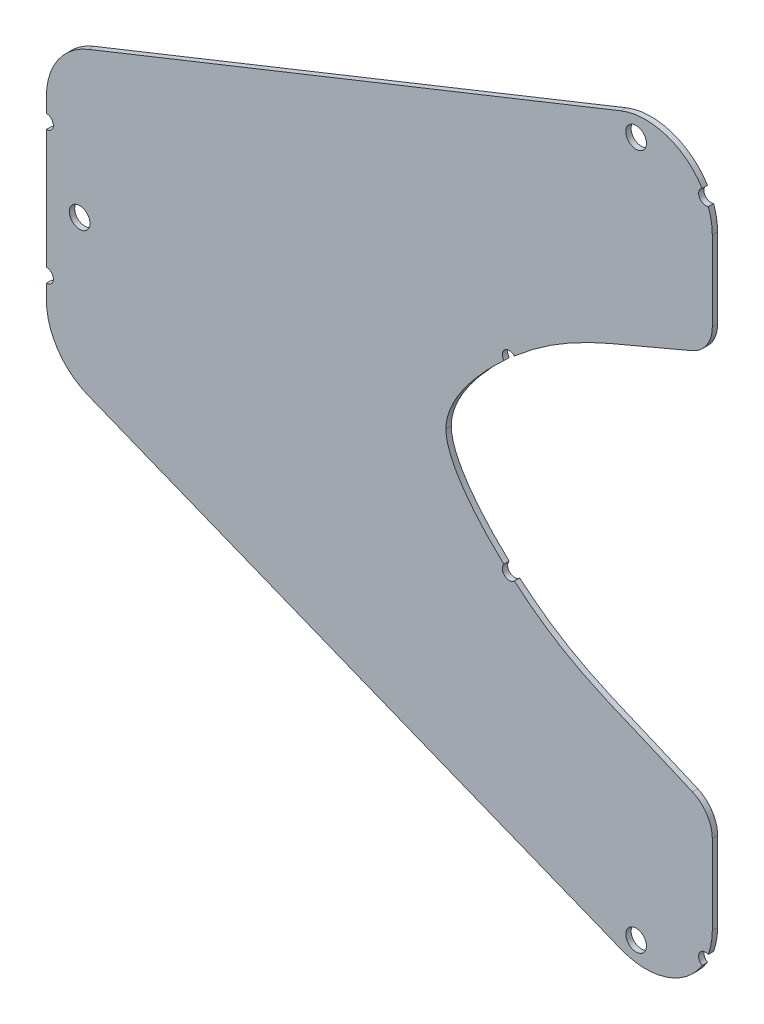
ISO-10303-21;
HEADER;
FILE_DESCRIPTION(('STEP AP214'),'2;1');
FILE_NAME('part.step','',(''),(''),'','','');
FILE_SCHEMA(('AUTOMOTIVE_DESIGN { 1 0 10303 214 1 1 1 1 }'));
ENDSEC;
DATA;
#1=APPLICATION_CONTEXT('core data for automotive mechanical design processes');
#2=APPLICATION_PROTOCOL_DEFINITION('international standard','automotive_design',2000,#1);
#3=PRODUCT_CONTEXT('',#1,'mechanical');
#4=PRODUCT('Part','Part','',(#3));
#5=PRODUCT_RELATED_PRODUCT_CATEGORY('part','',(#4));
#6=PRODUCT_DEFINITION_FORMATION('','',#4);
#7=PRODUCT_DEFINITION_CONTEXT('part definition',#1,'design');
#8=PRODUCT_DEFINITION('design','',#6,#7);
#9=PRODUCT_DEFINITION_SHAPE('','',#8);
#10=(LENGTH_UNIT() NAMED_UNIT(*) SI_UNIT(.MILLI.,.METRE.));
#11=(NAMED_UNIT(*) PLANE_ANGLE_UNIT() SI_UNIT($,.RADIAN.));
#12=(NAMED_UNIT(*) SI_UNIT($,.STERADIAN.) SOLID_ANGLE_UNIT());
#13=UNCERTAINTY_MEASURE_WITH_UNIT(LENGTH_MEASURE(1.E-05),#10,'distance_accuracy_value','');
#14=(GEOMETRIC_REPRESENTATION_CONTEXT(3) GLOBAL_UNCERTAINTY_ASSIGNED_CONTEXT((#13)) GLOBAL_UNIT_ASSIGNED_CONTEXT((#10,
#11,#12)) REPRESENTATION_CONTEXT('',''));
#15=CARTESIAN_POINT('',(0.,0.,0.));
#16=DIRECTION('',(0.,0.,1.));
#17=DIRECTION('',(1.,0.,0.));
#18=AXIS2_PLACEMENT_3D('',#15,#16,#17);
#19=CARTESIAN_POINT('',(62.677439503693,6.54379240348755,0.8));
#20=DIRECTION('',(0.,0.,-1.));
#21=DIRECTION('',(-1.,0.,0.));
#22=AXIS2_PLACEMENT_3D('',#19,#20,#21);
#23=PLANE('',#22);
#24=CARTESIAN_POINT('',(88.5590405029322,52.1925173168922,0.8));
#25=DIRECTION('',(0.,0.,1.));
#26=DIRECTION('',(1.,0.,0.));
#27=AXIS2_PLACEMENT_3D('',#24,#25,#26);
#28=CIRCLE('',#27,1.54999999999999);
#29=CARTESIAN_POINT('',(90.1090405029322,52.1925173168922,0.8));
#30=VERTEX_POINT('',#29);
#31=EDGE_CURVE('E691',#30,#30,#28,.T.);
#32=ORIENTED_EDGE('',*,*,#31,.F.);
#33=EDGE_LOOP('',(#32));
#34=FACE_BOUND('',#33,.T.);
#35=CARTESIAN_POINT('',(60.,0.,0.8));
#36=CARTESIAN_POINT('',(60.0183699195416,3.92846695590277,0.8));
#37=CARTESIAN_POINT('',(64.2193284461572,9.10855984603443,0.8));
#38=CARTESIAN_POINT('',(68.7064209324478,13.2392588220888,0.8));
#39=B_SPLINE_CURVE_WITH_KNOTS('',3,(#35,#36,#37,#38),.UNSPECIFIED.,.F.,.F.,(4,4),
(0.682096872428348,1.),.UNSPECIFIED.);
#40=CARTESIAN_POINT('',(60.,0.,0.8));
#41=VERTEX_POINT('',#40);
#42=CARTESIAN_POINT('',(68.7064209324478,13.2392588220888,0.8));
#43=VERTEX_POINT('',#42);
#44=EDGE_CURVE('E283',#41,#43,#39,.T.);
#45=ORIENTED_EDGE('',*,*,#44,.T.);
#46=CARTESIAN_POINT('',(69.5193173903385,13.9038634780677,0.8));
#47=DIRECTION('',(0.,0.,-1.));
#48=DIRECTION('',(1.,0.,0.));
#49=AXIS2_PLACEMENT_3D('',#46,#47,#48);
#50=CIRCLE('',#49,1.05000000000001);
#51=CARTESIAN_POINT('',(70.2753718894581,14.6324796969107,0.8));
#52=VERTEX_POINT('',#51);
#53=EDGE_CURVE('E210',#43,#52,#50,.T.);
#54=ORIENTED_EDGE('',*,*,#53,.T.);
#55=CARTESIAN_POINT('',(70.2753718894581,14.6324796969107,0.8));
#56=CARTESIAN_POINT('',(70.6636592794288,14.9651158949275,0.8));
#57=CARTESIAN_POINT('',(79.0680221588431,21.9752004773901,0.8));
#58=CARTESIAN_POINT('',(85.7089680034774,23.6688184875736,0.8));
#59=CARTESIAN_POINT('',(97.0260552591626,28.684890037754,0.8));
#60=B_SPLINE_CURVE_WITH_KNOTS('',3,(#55,#56,#57,#58,#59),.UNSPECIFIED.,.F.,.F.,(4,1,4),
(0.0496782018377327,0.0771027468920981,0.64517363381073),.UNSPECIFIED.);
#61=CARTESIAN_POINT('',(97.0260552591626,28.684890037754,0.8));
#62=VERTEX_POINT('',#61);
#63=EDGE_CURVE('E295',#52,#62,#60,.T.);
#64=ORIENTED_EDGE('',*,*,#63,.T.);
#65=CARTESIAN_POINT('',(95.,33.2560058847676,0.8));
#66=DIRECTION('',(0.,0.,1.));
#67=DIRECTION('',(-1.,0.,0.));
#68=AXIS2_PLACEMENT_3D('',#65,#66,#67);
#69=CIRCLE('',#68,5.);
#70=CARTESIAN_POINT('',(100.,33.2560058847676,0.8));
#71=VERTEX_POINT('',#70);
#72=EDGE_CURVE('E300',#62,#71,#69,.T.);
#73=ORIENTED_EDGE('',*,*,#72,.T.);
#74=DIRECTION('',(0.,1.,0.));
#75=VECTOR('',#74,1.);
#76=CARTESIAN_POINT('',(100.,45.2296703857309,0.8));
#77=LINE('',#76,#75);
#78=CARTESIAN_POINT('',(100.,45.2296703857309,0.8));
#79=VERTEX_POINT('',#78);
#80=EDGE_CURVE('E416',#71,#79,#77,.T.);
#81=ORIENTED_EDGE('',*,*,#80,.T.);
#82=CARTESIAN_POINT('',(90.,45.229670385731,0.8));
#83=DIRECTION('',(0.,0.,1.));
#84=DIRECTION('',(-1.,0.,0.));
#85=AXIS2_PLACEMENT_3D('',#82,#83,#84);
#86=CIRCLE('',#85,10.);
#87=CARTESIAN_POINT('',(99.4038271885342,48.6308516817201,0.8));
#88=VERTEX_POINT('',#87);
#89=EDGE_CURVE('E423',#79,#88,#86,.T.);
#90=ORIENTED_EDGE('',*,*,#89,.T.);
#91=CARTESIAN_POINT('',(98.995357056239,49.5981428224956,0.8));
#92=DIRECTION('',(0.,0.,-1.));
#93=DIRECTION('',(1.,0.,0.));
#94=AXIS2_PLACEMENT_3D('',#91,#92,#93);
#95=CIRCLE('',#94,1.05);
#96=CARTESIAN_POINT('',(98.4877131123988,50.5172715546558,0.8));
#97=VERTEX_POINT('',#96);
#98=EDGE_CURVE('E424',#88,#97,#95,.T.);
#99=ORIENTED_EDGE('',*,*,#98,.T.);
#100=CARTESIAN_POINT('',(90.,45.229670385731,0.8));
#101=DIRECTION('',(0.,0.,1.));
#102=DIRECTION('',(-1.,0.,0.));
#103=AXIS2_PLACEMENT_3D('',#100,#101,#102);
#104=CIRCLE('',#103,10.);
#105=CARTESIAN_POINT('',(86.2860932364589,54.5144372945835,0.8));
#106=VERTEX_POINT('',#105);
#107=EDGE_CURVE('E428',#97,#106,#104,.T.);
#108=ORIENTED_EDGE('',*,*,#107,.T.);
#109=DIRECTION('',(-0.928476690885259,-0.371390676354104,0.));
#110=VECTOR('',#109,1.);
#111=CARTESIAN_POINT('',(86.2860932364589,54.5144372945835,0.8));
#112=LINE('',#111,#110);
#113=CARTESIAN_POINT('',(6.28609323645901,22.5144372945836,0.8));
#114=VERTEX_POINT('',#113);
#115=EDGE_CURVE('E430',#106,#114,#112,.T.);
#116=ORIENTED_EDGE('',*,*,#115,.T.);
#117=CARTESIAN_POINT('',(10.,13.229670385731,0.8));
#118=DIRECTION('',(0.,0.,1.));
#119=DIRECTION('',(1.,0.,0.));
#120=AXIS2_PLACEMENT_3D('',#117,#118,#119);
#121=CIRCLE('',#120,10.);
#122=CARTESIAN_POINT('',(0.,13.2296703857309,0.8));
#123=VERTEX_POINT('',#122);
#124=EDGE_CURVE('E432',#114,#123,#121,.T.);
#125=ORIENTED_EDGE('',*,*,#124,.T.);
#126=DIRECTION('',(0.,-1.,0.));
#127=VECTOR('',#126,1.);
#128=CARTESIAN_POINT('',(0.,13.2296703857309,0.8));
#129=LINE('',#128,#127);
#130=CARTESIAN_POINT('',(0.,11.05,0.8));
#131=VERTEX_POINT('',#130);
#132=EDGE_CURVE('E434',#123,#131,#129,.T.);
#133=ORIENTED_EDGE('',*,*,#132,.T.);
#134=CARTESIAN_POINT('',(0.,10.,0.8));
#135=DIRECTION('',(0.,0.,-1.));
#136=DIRECTION('',(1.,0.,0.));
#137=AXIS2_PLACEMENT_3D('',#134,#135,#136);
#138=CIRCLE('',#137,1.05);
#139=CARTESIAN_POINT('',(0.,8.95,0.8));
#140=VERTEX_POINT('',#139);
#141=EDGE_CURVE('E436',#131,#140,#138,.T.);
#142=ORIENTED_EDGE('',*,*,#141,.T.);
#143=DIRECTION('',(0.,-1.,0.));
#144=VECTOR('',#143,1.);
#145=CARTESIAN_POINT('',(0.,8.95,0.8));
#146=LINE('',#145,#144);
#147=CARTESIAN_POINT('',(0.,-8.95,0.8));
#148=VERTEX_POINT('',#147);
#149=EDGE_CURVE('E438',#140,#148,#146,.T.);
#150=ORIENTED_EDGE('',*,*,#149,.T.);
#151=CARTESIAN_POINT('',(0.,-10.,0.8));
#152=DIRECTION('',(0.,0.,-1.));
#153=DIRECTION('',(-1.,0.,0.));
#154=AXIS2_PLACEMENT_3D('',#151,#152,#153);
#155=CIRCLE('',#154,1.05);
#156=CARTESIAN_POINT('',(0.,-11.05,0.8));
#157=VERTEX_POINT('',#156);
#158=EDGE_CURVE('E440',#148,#157,#155,.T.);
#159=ORIENTED_EDGE('',*,*,#158,.T.);
#160=DIRECTION('',(0.,-1.,0.));
#161=VECTOR('',#160,1.);
#162=CARTESIAN_POINT('',(0.,-11.05,0.8));
#163=LINE('',#162,#161);
#164=CARTESIAN_POINT('',(0.,-13.2296703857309,0.8));
#165=VERTEX_POINT('',#164);
#166=EDGE_CURVE('E442',#157,#165,#163,.T.);
#167=ORIENTED_EDGE('',*,*,#166,.T.);
#168=CARTESIAN_POINT('',(10.,-13.229670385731,0.8));
#169=DIRECTION('',(0.,0.,1.));
#170=DIRECTION('',(-1.,0.,0.));
#171=AXIS2_PLACEMENT_3D('',#168,#169,#170);
#172=CIRCLE('',#171,10.);
#173=CARTESIAN_POINT('',(6.28609323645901,-22.5144372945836,0.8));
#174=VERTEX_POINT('',#173);
#175=EDGE_CURVE('E444',#165,#174,#172,.T.);
#176=ORIENTED_EDGE('',*,*,#175,.T.);
#177=DIRECTION('',(0.928476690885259,-0.371390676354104,0.));
#178=VECTOR('',#177,1.);
#179=CARTESIAN_POINT('',(86.2860932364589,-54.5144372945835,0.8));
#180=LINE('',#179,#178);
#181=CARTESIAN_POINT('',(86.2860932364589,-54.5144372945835,0.8));
#182=VERTEX_POINT('',#181);
#183=EDGE_CURVE('E446',#174,#182,#180,.T.);
#184=ORIENTED_EDGE('',*,*,#183,.T.);
#185=CARTESIAN_POINT('',(90.,-45.229670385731,0.8));
#186=DIRECTION('',(0.,0.,1.));
#187=DIRECTION('',(1.,0.,0.));
#188=AXIS2_PLACEMENT_3D('',#185,#186,#187);
#189=CIRCLE('',#188,10.);
#190=CARTESIAN_POINT('',(98.4877131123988,-50.5172715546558,0.8));
#191=VERTEX_POINT('',#190);
#192=EDGE_CURVE('E448',#182,#191,#189,.T.);
#193=ORIENTED_EDGE('',*,*,#192,.T.);
#194=CARTESIAN_POINT('',(98.995357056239,-49.5981428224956,0.8));
#195=DIRECTION('',(0.,0.,-1.));
#196=DIRECTION('',(-1.,0.,0.));
#197=AXIS2_PLACEMENT_3D('',#194,#195,#196);
#198=CIRCLE('',#197,1.05);
#199=CARTESIAN_POINT('',(99.4038271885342,-48.6308516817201,0.8));
#200=VERTEX_POINT('',#199);
#201=EDGE_CURVE('E450',#191,#200,#198,.T.);
#202=ORIENTED_EDGE('',*,*,#201,.T.);
#203=CARTESIAN_POINT('',(90.,-45.229670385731,0.8));
#204=DIRECTION('',(0.,0.,1.));
#205=DIRECTION('',(1.,0.,0.));
#206=AXIS2_PLACEMENT_3D('',#203,#204,#205);
#207=CIRCLE('',#206,10.);
#208=CARTESIAN_POINT('',(100.,-45.2296703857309,0.8));
#209=VERTEX_POINT('',#208);
#210=EDGE_CURVE('E452',#200,#209,#207,.T.);
#211=ORIENTED_EDGE('',*,*,#210,.T.);
#212=DIRECTION('',(0.,1.,0.));
#213=VECTOR('',#212,1.);
#214=CARTESIAN_POINT('',(100.,-45.2296703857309,0.8));
#215=LINE('',#214,#213);
#216=CARTESIAN_POINT('',(100.,-33.2560058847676,0.8));
#217=VERTEX_POINT('',#216);
#218=EDGE_CURVE('E454',#209,#217,#215,.T.);
#219=ORIENTED_EDGE('',*,*,#218,.T.);
#220=CARTESIAN_POINT('',(95.,-33.2560058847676,0.8));
#221=DIRECTION('',(0.,0.,1.));
#222=DIRECTION('',(1.,0.,0.));
#223=AXIS2_PLACEMENT_3D('',#220,#221,#222);
#224=CIRCLE('',#223,5.);
#225=CARTESIAN_POINT('',(97.0260552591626,-28.684890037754,0.8));
#226=VERTEX_POINT('',#225);
#227=EDGE_CURVE('E456',#217,#226,#224,.T.);
#228=ORIENTED_EDGE('',*,*,#227,.T.);
#229=CARTESIAN_POINT('',(97.0260552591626,-28.684890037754,0.8));
#230=CARTESIAN_POINT('',(85.7089680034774,-23.6688184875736,0.8));
#231=CARTESIAN_POINT('',(79.0680221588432,-21.9752004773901,0.8));
#232=CARTESIAN_POINT('',(70.6636592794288,-14.9651158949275,0.8));
#233=CARTESIAN_POINT('',(70.2753718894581,-14.6324796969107,0.8));
#234=B_SPLINE_CURVE_WITH_KNOTS('',3,(#229,#230,#231,#232,#233),.UNSPECIFIED.,.F.,.F.,(4,1,4),
(0.0496782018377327,0.617749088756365,0.64517363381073),.UNSPECIFIED.);
#235=CARTESIAN_POINT('',(70.2753718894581,-14.6324796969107,0.8));
#236=VERTEX_POINT('',#235);
#237=EDGE_CURVE('E457',#226,#236,#234,.T.);
#238=ORIENTED_EDGE('',*,*,#237,.T.);
#239=CARTESIAN_POINT('',(69.5193173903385,-13.9038634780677,0.8));
#240=DIRECTION('',(0.,0.,-1.));
#241=DIRECTION('',(-1.,0.,0.));
#242=AXIS2_PLACEMENT_3D('',#239,#240,#241);
#243=CIRCLE('',#242,1.05000000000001);
#244=CARTESIAN_POINT('',(68.7064209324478,-13.2392588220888,0.8));
#245=VERTEX_POINT('',#244);
#246=EDGE_CURVE('E49',#236,#245,#243,.T.);
#247=ORIENTED_EDGE('',*,*,#246,.T.);
#248=CARTESIAN_POINT('',(68.7064209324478,-13.2392588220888,0.8));
#249=CARTESIAN_POINT('',(64.2193284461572,-9.10855984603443,0.8));
#250=CARTESIAN_POINT('',(60.0183699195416,-3.92846695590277,0.8));
#251=CARTESIAN_POINT('',(60.,0.,0.8));
#252=B_SPLINE_CURVE_WITH_KNOTS('',3,(#248,#249,#250,#251),.UNSPECIFIED.,.F.,.F.,(4,4),
(0.682096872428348,1.),.UNSPECIFIED.);
#253=EDGE_CURVE('E44',#245,#41,#252,.T.);
#254=ORIENTED_EDGE('',*,*,#253,.T.);
#255=EDGE_LOOP('',(#45,#54,#64,#73,#81,#90,#99,#108,#116,#125,#133,#142,#150,#159,#167,#176,
#184,#193,#202,#211,#219,#228,#238,#247,#254));
#256=FACE_BOUND('',#255,.T.);
#257=CARTESIAN_POINT('',(5.,0.,0.8));
#258=DIRECTION('',(0.,0.,1.));
#259=DIRECTION('',(1.,0.,0.));
#260=AXIS2_PLACEMENT_3D('',#257,#258,#259);
#261=CIRCLE('',#260,1.55);
#262=CARTESIAN_POINT('',(6.55,0.,0.8));
#263=VERTEX_POINT('',#262);
#264=EDGE_CURVE('E215',#263,#263,#261,.T.);
#265=ORIENTED_EDGE('',*,*,#264,.F.);
#266=EDGE_LOOP('',(#265));
#267=FACE_BOUND('',#266,.T.);
#268=CARTESIAN_POINT('',(88.5590405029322,-52.1925173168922,0.8));
#269=DIRECTION('',(0.,0.,1.));
#270=DIRECTION('',(-1.,0.,0.));
#271=AXIS2_PLACEMENT_3D('',#268,#269,#270);
#272=CIRCLE('',#271,1.54999999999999);
#273=CARTESIAN_POINT('',(87.0090405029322,-52.1925173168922,0.8));
#274=VERTEX_POINT('',#273);
#275=EDGE_CURVE('E680',#274,#274,#272,.T.);
#276=ORIENTED_EDGE('',*,*,#275,.F.);
#277=EDGE_LOOP('',(#276));
#278=FACE_BOUND('',#277,.T.);
#279=ADVANCED_FACE('F28',(#34,#256,#267,#278),#23,.F.);
#280=CARTESIAN_POINT('',(62.677439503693,6.54379240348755,0.));
#281=DIRECTION('',(0.,0.,-1.));
#282=DIRECTION('',(-1.,0.,0.));
#283=AXIS2_PLACEMENT_3D('',#280,#281,#282);
#284=PLANE('',#283);
#285=CARTESIAN_POINT('',(88.5590405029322,52.1925173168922,0.));
#286=DIRECTION('',(0.,0.,1.));
#287=DIRECTION('',(1.,0.,0.));
#288=AXIS2_PLACEMENT_3D('',#285,#286,#287);
#289=CIRCLE('',#288,1.54999999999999);
#290=CARTESIAN_POINT('',(90.1090405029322,52.1925173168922,0.));
#291=VERTEX_POINT('',#290);
#292=EDGE_CURVE('E686',#291,#291,#289,.T.);
#293=ORIENTED_EDGE('',*,*,#292,.T.);
#294=EDGE_LOOP('',(#293));
#295=FACE_BOUND('',#294,.T.);
#296=CARTESIAN_POINT('',(60.,0.,0.));
#297=CARTESIAN_POINT('',(60.0183699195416,3.92846695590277,0.));
#298=CARTESIAN_POINT('',(64.2193284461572,9.10855984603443,0.));
#299=CARTESIAN_POINT('',(68.7064209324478,13.2392588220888,0.));
#300=B_SPLINE_CURVE_WITH_KNOTS('',3,(#296,#297,#298,#299),.UNSPECIFIED.,.F.,.F.,(4,4),
(0.682096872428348,1.),.UNSPECIFIED.);
#301=CARTESIAN_POINT('',(60.,0.,0.));
#302=VERTEX_POINT('',#301);
#303=CARTESIAN_POINT('',(68.7064209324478,13.2392588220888,0.));
#304=VERTEX_POINT('',#303);
#305=EDGE_CURVE('E201',#302,#304,#300,.T.);
#306=ORIENTED_EDGE('',*,*,#305,.F.);
#307=CARTESIAN_POINT('',(68.7064209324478,-13.2392588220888,0.));
#308=CARTESIAN_POINT('',(64.2193284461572,-9.10855984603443,0.));
#309=CARTESIAN_POINT('',(60.0183699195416,-3.92846695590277,0.));
#310=CARTESIAN_POINT('',(60.,0.,0.));
#311=B_SPLINE_CURVE_WITH_KNOTS('',3,(#307,#308,#309,#310),.UNSPECIFIED.,.F.,.F.,(4,4),
(0.682096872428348,1.),.UNSPECIFIED.);
#312=CARTESIAN_POINT('',(68.7064209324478,-13.2392588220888,0.));
#313=VERTEX_POINT('',#312);
#314=EDGE_CURVE('E280',#313,#302,#311,.T.);
#315=ORIENTED_EDGE('',*,*,#314,.F.);
#316=CARTESIAN_POINT('',(69.5193173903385,-13.9038634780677,0.));
#317=DIRECTION('',(0.,0.,-1.));
#318=DIRECTION('',(-1.,0.,0.));
#319=AXIS2_PLACEMENT_3D('',#316,#317,#318);
#320=CIRCLE('',#319,1.05000000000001);
#321=CARTESIAN_POINT('',(70.2753718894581,-14.6324796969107,0.));
#322=VERTEX_POINT('',#321);
#323=EDGE_CURVE('E275',#322,#313,#320,.T.);
#324=ORIENTED_EDGE('',*,*,#323,.F.);
#325=CARTESIAN_POINT('',(97.0260552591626,-28.684890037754,0.));
#326=CARTESIAN_POINT('',(85.7089680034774,-23.6688184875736,0.));
#327=CARTESIAN_POINT('',(79.0680221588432,-21.9752004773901,0.));
#328=CARTESIAN_POINT('',(70.6636592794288,-14.9651158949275,0.));
#329=CARTESIAN_POINT('',(70.2753718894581,-14.6324796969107,0.));
#330=B_SPLINE_CURVE_WITH_KNOTS('',3,(#325,#326,#327,#328,#329),.UNSPECIFIED.,.F.,.F.,(4,1,4),
(0.0496782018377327,0.617749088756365,0.64517363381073),.UNSPECIFIED.);
#331=CARTESIAN_POINT('',(97.0260552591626,-28.684890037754,0.));
#332=VERTEX_POINT('',#331);
#333=EDGE_CURVE('E271',#332,#322,#330,.T.);
#334=ORIENTED_EDGE('',*,*,#333,.F.);
#335=CARTESIAN_POINT('',(95.,-33.2560058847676,0.));
#336=DIRECTION('',(0.,0.,1.));
#337=DIRECTION('',(1.,0.,0.));
#338=AXIS2_PLACEMENT_3D('',#335,#336,#337);
#339=CIRCLE('',#338,5.);
#340=CARTESIAN_POINT('',(100.,-33.2560058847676,0.));
#341=VERTEX_POINT('',#340);
#342=EDGE_CURVE('E269',#341,#332,#339,.T.);
#343=ORIENTED_EDGE('',*,*,#342,.F.);
#344=DIRECTION('',(0.,1.,0.));
#345=VECTOR('',#344,1.);
#346=CARTESIAN_POINT('',(100.,-45.2296703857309,0.));
#347=LINE('',#346,#345);
#348=CARTESIAN_POINT('',(100.,-45.2296703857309,0.));
#349=VERTEX_POINT('',#348);
#350=EDGE_CURVE('E267',#349,#341,#347,.T.);
#351=ORIENTED_EDGE('',*,*,#350,.F.);
#352=CARTESIAN_POINT('',(90.,-45.229670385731,0.));
#353=DIRECTION('',(0.,0.,1.));
#354=DIRECTION('',(1.,0.,0.));
#355=AXIS2_PLACEMENT_3D('',#352,#353,#354);
#356=CIRCLE('',#355,10.);
#357=CARTESIAN_POINT('',(99.4038271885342,-48.6308516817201,0.));
#358=VERTEX_POINT('',#357);
#359=EDGE_CURVE('E265',#358,#349,#356,.T.);
#360=ORIENTED_EDGE('',*,*,#359,.F.);
#361=CARTESIAN_POINT('',(98.995357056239,-49.5981428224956,0.));
#362=DIRECTION('',(0.,0.,-1.));
#363=DIRECTION('',(-1.,0.,0.));
#364=AXIS2_PLACEMENT_3D('',#361,#362,#363);
#365=CIRCLE('',#364,1.05);
#366=CARTESIAN_POINT('',(98.4877131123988,-50.5172715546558,0.));
#367=VERTEX_POINT('',#366);
#368=EDGE_CURVE('E263',#367,#358,#365,.T.);
#369=ORIENTED_EDGE('',*,*,#368,.F.);
#370=CARTESIAN_POINT('',(90.,-45.229670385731,0.));
#371=DIRECTION('',(0.,0.,1.));
#372=DIRECTION('',(1.,0.,0.));
#373=AXIS2_PLACEMENT_3D('',#370,#371,#372);
#374=CIRCLE('',#373,10.);
#375=CARTESIAN_POINT('',(86.2860932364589,-54.5144372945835,0.));
#376=VERTEX_POINT('',#375);
#377=EDGE_CURVE('E261',#376,#367,#374,.T.);
#378=ORIENTED_EDGE('',*,*,#377,.F.);
#379=DIRECTION('',(0.928476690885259,-0.371390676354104,0.));
#380=VECTOR('',#379,1.);
#381=CARTESIAN_POINT('',(86.2860932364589,-54.5144372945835,0.));
#382=LINE('',#381,#380);
#383=CARTESIAN_POINT('',(6.28609323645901,-22.5144372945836,0.));
#384=VERTEX_POINT('',#383);
#385=EDGE_CURVE('E259',#384,#376,#382,.T.);
#386=ORIENTED_EDGE('',*,*,#385,.F.);
#387=CARTESIAN_POINT('',(10.,-13.229670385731,0.));
#388=DIRECTION('',(0.,0.,1.));
#389=DIRECTION('',(-1.,0.,0.));
#390=AXIS2_PLACEMENT_3D('',#387,#388,#389);
#391=CIRCLE('',#390,10.);
#392=CARTESIAN_POINT('',(0.,-13.2296703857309,0.));
#393=VERTEX_POINT('',#392);
#394=EDGE_CURVE('E257',#393,#384,#391,.T.);
#395=ORIENTED_EDGE('',*,*,#394,.F.);
#396=DIRECTION('',(0.,-1.,0.));
#397=VECTOR('',#396,1.);
#398=CARTESIAN_POINT('',(0.,-11.05,0.));
#399=LINE('',#398,#397);
#400=CARTESIAN_POINT('',(0.,-11.05,0.));
#401=VERTEX_POINT('',#400);
#402=EDGE_CURVE('E255',#401,#393,#399,.T.);
#403=ORIENTED_EDGE('',*,*,#402,.F.);
#404=CARTESIAN_POINT('',(0.,-10.,0.));
#405=DIRECTION('',(0.,0.,-1.));
#406=DIRECTION('',(-1.,0.,0.));
#407=AXIS2_PLACEMENT_3D('',#404,#405,#406);
#408=CIRCLE('',#407,1.05);
#409=CARTESIAN_POINT('',(0.,-8.95,0.));
#410=VERTEX_POINT('',#409);
#411=EDGE_CURVE('E253',#410,#401,#408,.T.);
#412=ORIENTED_EDGE('',*,*,#411,.F.);
#413=DIRECTION('',(0.,-1.,0.));
#414=VECTOR('',#413,1.);
#415=CARTESIAN_POINT('',(0.,8.95,0.));
#416=LINE('',#415,#414);
#417=CARTESIAN_POINT('',(0.,8.95,0.));
#418=VERTEX_POINT('',#417);
#419=EDGE_CURVE('E251',#418,#410,#416,.T.);
#420=ORIENTED_EDGE('',*,*,#419,.F.);
#421=CARTESIAN_POINT('',(0.,10.,0.));
#422=DIRECTION('',(0.,0.,-1.));
#423=DIRECTION('',(1.,0.,0.));
#424=AXIS2_PLACEMENT_3D('',#421,#422,#423);
#425=CIRCLE('',#424,1.05);
#426=CARTESIAN_POINT('',(0.,11.05,0.));
#427=VERTEX_POINT('',#426);
#428=EDGE_CURVE('E249',#427,#418,#425,.T.);
#429=ORIENTED_EDGE('',*,*,#428,.F.);
#430=DIRECTION('',(0.,-1.,0.));
#431=VECTOR('',#430,1.);
#432=CARTESIAN_POINT('',(0.,13.2296703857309,0.));
#433=LINE('',#432,#431);
#434=CARTESIAN_POINT('',(0.,13.2296703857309,0.));
#435=VERTEX_POINT('',#434);
#436=EDGE_CURVE('E247',#435,#427,#433,.T.);
#437=ORIENTED_EDGE('',*,*,#436,.F.);
#438=CARTESIAN_POINT('',(10.,13.229670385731,0.));
#439=DIRECTION('',(0.,0.,1.));
#440=DIRECTION('',(1.,0.,0.));
#441=AXIS2_PLACEMENT_3D('',#438,#439,#440);
#442=CIRCLE('',#441,10.);
#443=CARTESIAN_POINT('',(6.28609323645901,22.5144372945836,0.));
#444=VERTEX_POINT('',#443);
#445=EDGE_CURVE('E245',#444,#435,#442,.T.);
#446=ORIENTED_EDGE('',*,*,#445,.F.);
#447=DIRECTION('',(-0.928476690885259,-0.371390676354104,0.));
#448=VECTOR('',#447,1.);
#449=CARTESIAN_POINT('',(86.2860932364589,54.5144372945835,0.));
#450=LINE('',#449,#448);
#451=CARTESIAN_POINT('',(86.2860932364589,54.5144372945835,0.));
#452=VERTEX_POINT('',#451);
#453=EDGE_CURVE('E243',#452,#444,#450,.T.);
#454=ORIENTED_EDGE('',*,*,#453,.F.);
#455=CARTESIAN_POINT('',(90.,45.229670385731,0.));
#456=DIRECTION('',(0.,0.,1.));
#457=DIRECTION('',(-1.,0.,0.));
#458=AXIS2_PLACEMENT_3D('',#455,#456,#457);
#459=CIRCLE('',#458,10.);
#460=CARTESIAN_POINT('',(98.4877131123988,50.5172715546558,0.));
#461=VERTEX_POINT('',#460);
#462=EDGE_CURVE('E241',#461,#452,#459,.T.);
#463=ORIENTED_EDGE('',*,*,#462,.F.);
#464=CARTESIAN_POINT('',(98.995357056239,49.5981428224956,0.));
#465=DIRECTION('',(0.,0.,-1.));
#466=DIRECTION('',(1.,0.,0.));
#467=AXIS2_PLACEMENT_3D('',#464,#465,#466);
#468=CIRCLE('',#467,1.05);
#469=CARTESIAN_POINT('',(99.4038271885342,48.6308516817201,0.));
#470=VERTEX_POINT('',#469);
#471=EDGE_CURVE('E239',#470,#461,#468,.T.);
#472=ORIENTED_EDGE('',*,*,#471,.F.);
#473=CARTESIAN_POINT('',(90.,45.229670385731,0.));
#474=DIRECTION('',(0.,0.,1.));
#475=DIRECTION('',(-1.,0.,0.));
#476=AXIS2_PLACEMENT_3D('',#473,#474,#475);
#477=CIRCLE('',#476,10.);
#478=CARTESIAN_POINT('',(100.,45.2296703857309,0.));
#479=VERTEX_POINT('',#478);
#480=EDGE_CURVE('E237',#479,#470,#477,.T.);
#481=ORIENTED_EDGE('',*,*,#480,.F.);
#482=DIRECTION('',(0.,1.,0.));
#483=VECTOR('',#482,1.);
#484=CARTESIAN_POINT('',(100.,45.2296703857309,0.));
#485=LINE('',#484,#483);
#486=CARTESIAN_POINT('',(100.,33.2560058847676,0.));
#487=VERTEX_POINT('',#486);
#488=EDGE_CURVE('E235',#487,#479,#485,.T.);
#489=ORIENTED_EDGE('',*,*,#488,.F.);
#490=CARTESIAN_POINT('',(95.,33.2560058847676,0.));
#491=DIRECTION('',(0.,0.,1.));
#492=DIRECTION('',(-1.,0.,0.));
#493=AXIS2_PLACEMENT_3D('',#490,#491,#492);
#494=CIRCLE('',#493,5.);
#495=CARTESIAN_POINT('',(97.0260552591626,28.684890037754,0.));
#496=VERTEX_POINT('',#495);
#497=EDGE_CURVE('E230',#496,#487,#494,.T.);
#498=ORIENTED_EDGE('',*,*,#497,.F.);
#499=CARTESIAN_POINT('',(70.2753718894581,14.6324796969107,0.));
#500=CARTESIAN_POINT('',(70.6636592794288,14.9651158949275,0.));
#501=CARTESIAN_POINT('',(79.0680221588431,21.9752004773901,0.));
#502=CARTESIAN_POINT('',(85.7089680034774,23.6688184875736,0.));
#503=CARTESIAN_POINT('',(97.0260552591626,28.684890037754,0.));
#504=B_SPLINE_CURVE_WITH_KNOTS('',3,(#499,#500,#501,#502,#503),.UNSPECIFIED.,.F.,.F.,(4,1,4),
(0.0496782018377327,0.0771027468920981,0.64517363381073),.UNSPECIFIED.);
#505=CARTESIAN_POINT('',(70.2753718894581,14.6324796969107,0.));
#506=VERTEX_POINT('',#505);
#507=EDGE_CURVE('E203',#506,#496,#504,.T.);
#508=ORIENTED_EDGE('',*,*,#507,.F.);
#509=CARTESIAN_POINT('',(69.5193173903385,13.9038634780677,0.));
#510=DIRECTION('',(0.,0.,-1.));
#511=DIRECTION('',(1.,0.,0.));
#512=AXIS2_PLACEMENT_3D('',#509,#510,#511);
#513=CIRCLE('',#512,1.05000000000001);
#514=EDGE_CURVE('E196',#304,#506,#513,.T.);
#515=ORIENTED_EDGE('',*,*,#514,.F.);
#516=EDGE_LOOP('',(#306,#315,#324,#334,#343,#351,#360,#369,#378,#386,#395,#403,#412,#420,#429,
#437,#446,#454,#463,#472,#481,#489,#498,#508,#515));
#517=FACE_BOUND('',#516,.T.);
#518=CARTESIAN_POINT('',(5.,0.,0.));
#519=DIRECTION('',(0.,0.,1.));
#520=DIRECTION('',(1.,0.,0.));
#521=AXIS2_PLACEMENT_3D('',#518,#519,#520);
#522=CIRCLE('',#521,1.55);
#523=CARTESIAN_POINT('',(6.55,0.,0.));
#524=VERTEX_POINT('',#523);
#525=EDGE_CURVE('E218',#524,#524,#522,.T.);
#526=ORIENTED_EDGE('',*,*,#525,.T.);
#527=EDGE_LOOP('',(#526));
#528=FACE_BOUND('',#527,.T.);
#529=CARTESIAN_POINT('',(88.5590405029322,-52.1925173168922,0.));
#530=DIRECTION('',(0.,0.,1.));
#531=DIRECTION('',(-1.,0.,0.));
#532=AXIS2_PLACEMENT_3D('',#529,#530,#531);
#533=CIRCLE('',#532,1.54999999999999);
#534=CARTESIAN_POINT('',(87.0090405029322,-52.1925173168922,0.));
#535=VERTEX_POINT('',#534);
#536=EDGE_CURVE('E683',#535,#535,#533,.T.);
#537=ORIENTED_EDGE('',*,*,#536,.T.);
#538=EDGE_LOOP('',(#537));
#539=FACE_BOUND('',#538,.T.);
#540=ADVANCED_FACE('F197',(#295,#517,#528,#539),#284,.T.);
#541=DIRECTION('',(0.,0.,-1.));
#542=VECTOR('',#541,1.);
#543=SURFACE_OF_LINEAR_EXTRUSION('',#39,#542);
#544=ORIENTED_EDGE('',*,*,#305,.T.);
#545=DIRECTION('',(0.,0.,-1.));
#546=VECTOR('',#545,1.);
#547=CARTESIAN_POINT('',(68.7064209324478,13.2392588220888,0.8));
#548=LINE('',#547,#546);
#549=EDGE_CURVE('E11',#43,#304,#548,.T.);
#550=ORIENTED_EDGE('',*,*,#549,.F.);
#551=ORIENTED_EDGE('',*,*,#44,.F.);
#552=DIRECTION('',(0.,0.,-1.));
#553=VECTOR('',#552,1.);
#554=CARTESIAN_POINT('',(60.,0.,0.8));
#555=LINE('',#554,#553);
#556=EDGE_CURVE('E214',#41,#302,#555,.T.);
#557=ORIENTED_EDGE('',*,*,#556,.T.);
#558=EDGE_LOOP('',(#544,#550,#551,#557));
#559=FACE_BOUND('',#558,.T.);
#560=ADVANCED_FACE('F30',(#559),#543,.F.);
#561=CARTESIAN_POINT('',(69.5193173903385,13.9038634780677,0.8));
#562=DIRECTION('',(0.,0.,-1.));
#563=DIRECTION('',(-1.,0.,0.));
#564=AXIS2_PLACEMENT_3D('',#561,#562,#563);
#565=CYLINDRICAL_SURFACE('',#564,1.05000000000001);
#566=ORIENTED_EDGE('',*,*,#514,.T.);
#567=DIRECTION('',(0.,0.,-1.));
#568=VECTOR('',#567,1.);
#569=CARTESIAN_POINT('',(70.2753718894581,14.6324796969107,0.8));
#570=LINE('',#569,#568);
#571=EDGE_CURVE('E37',#52,#506,#570,.T.);
#572=ORIENTED_EDGE('',*,*,#571,.F.);
#573=ORIENTED_EDGE('',*,*,#53,.F.);
#574=ORIENTED_EDGE('',*,*,#549,.T.);
#575=EDGE_LOOP('',(#566,#572,#573,#574));
#576=FACE_BOUND('',#575,.T.);
#577=ADVANCED_FACE('F209',(#576),#565,.F.);
#578=DIRECTION('',(0.,0.,-1.));
#579=VECTOR('',#578,1.);
#580=SURFACE_OF_LINEAR_EXTRUSION('',#60,#579);
#581=ORIENTED_EDGE('',*,*,#507,.T.);
#582=DIRECTION('',(0.,0.,-1.));
#583=VECTOR('',#582,1.);
#584=CARTESIAN_POINT('',(97.0260552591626,28.684890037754,0.8));
#585=LINE('',#584,#583);
#586=EDGE_CURVE('E408',#62,#496,#585,.T.);
#587=ORIENTED_EDGE('',*,*,#586,.F.);
#588=ORIENTED_EDGE('',*,*,#63,.F.);
#589=ORIENTED_EDGE('',*,*,#571,.T.);
#590=EDGE_LOOP('',(#581,#587,#588,#589));
#591=FACE_BOUND('',#590,.T.);
#592=ADVANCED_FACE('F306',(#591),#580,.F.);
#593=CARTESIAN_POINT('',(95.,33.2560058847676,0.8));
#594=DIRECTION('',(0.,0.,-1.));
#595=DIRECTION('',(-1.,0.,0.));
#596=AXIS2_PLACEMENT_3D('',#593,#594,#595);
#597=CYLINDRICAL_SURFACE('',#596,5.);
#598=ORIENTED_EDGE('',*,*,#497,.T.);
#599=DIRECTION('',(0.,0.,-1.));
#600=VECTOR('',#599,1.);
#601=CARTESIAN_POINT('',(100.,33.2560058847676,0.8));
#602=LINE('',#601,#600);
#603=EDGE_CURVE('E405',#71,#487,#602,.T.);
#604=ORIENTED_EDGE('',*,*,#603,.F.);
#605=ORIENTED_EDGE('',*,*,#72,.F.);
#606=ORIENTED_EDGE('',*,*,#586,.T.);
#607=EDGE_LOOP('',(#598,#604,#605,#606));
#608=FACE_BOUND('',#607,.T.);
#609=ADVANCED_FACE('F309',(#608),#597,.T.);
#610=CARTESIAN_POINT('',(100.,45.2296703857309,0.8));
#611=DIRECTION('',(-1.,0.,0.));
#612=DIRECTION('',(0.,0.,1.));
#613=AXIS2_PLACEMENT_3D('',#610,#611,#612);
#614=PLANE('',#613);
#615=ORIENTED_EDGE('',*,*,#488,.T.);
#616=DIRECTION('',(0.,0.,-1.));
#617=VECTOR('',#616,1.);
#618=CARTESIAN_POINT('',(100.,45.2296703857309,0.8));
#619=LINE('',#618,#617);
#620=EDGE_CURVE('E402',#79,#479,#619,.T.);
#621=ORIENTED_EDGE('',*,*,#620,.F.);
#622=ORIENTED_EDGE('',*,*,#80,.F.);
#623=ORIENTED_EDGE('',*,*,#603,.T.);
#624=EDGE_LOOP('',(#615,#621,#622,#623));
#625=FACE_BOUND('',#624,.T.);
#626=ADVANCED_FACE('F421',(#625),#614,.F.);
#627=CARTESIAN_POINT('',(90.,45.229670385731,0.8));
#628=DIRECTION('',(0.,0.,-1.));
#629=DIRECTION('',(-1.,0.,0.));
#630=AXIS2_PLACEMENT_3D('',#627,#628,#629);
#631=CYLINDRICAL_SURFACE('',#630,10.);
#632=ORIENTED_EDGE('',*,*,#480,.T.);
#633=DIRECTION('',(0.,0.,-1.));
#634=VECTOR('',#633,1.);
#635=CARTESIAN_POINT('',(99.4038271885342,48.6308516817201,0.8));
#636=LINE('',#635,#634);
#637=EDGE_CURVE('E399',#88,#470,#636,.T.);
#638=ORIENTED_EDGE('',*,*,#637,.F.);
#639=ORIENTED_EDGE('',*,*,#89,.F.);
#640=ORIENTED_EDGE('',*,*,#620,.T.);
#641=EDGE_LOOP('',(#632,#638,#639,#640));
#642=FACE_BOUND('',#641,.T.);
#643=ADVANCED_FACE('F531',(#642),#631,.T.);
#644=CARTESIAN_POINT('',(98.995357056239,49.5981428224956,0.8));
#645=DIRECTION('',(0.,0.,-1.));
#646=DIRECTION('',(-1.,0.,0.));
#647=AXIS2_PLACEMENT_3D('',#644,#645,#646);
#648=CYLINDRICAL_SURFACE('',#647,1.05);
#649=ORIENTED_EDGE('',*,*,#471,.T.);
#650=DIRECTION('',(0.,0.,-1.));
#651=VECTOR('',#650,1.);
#652=CARTESIAN_POINT('',(98.4877131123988,50.5172715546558,0.8));
#653=LINE('',#652,#651);
#654=EDGE_CURVE('E396',#97,#461,#653,.T.);
#655=ORIENTED_EDGE('',*,*,#654,.F.);
#656=ORIENTED_EDGE('',*,*,#98,.F.);
#657=ORIENTED_EDGE('',*,*,#637,.T.);
#658=EDGE_LOOP('',(#649,#655,#656,#657));
#659=FACE_BOUND('',#658,.T.);
#660=ADVANCED_FACE('F527',(#659),#648,.F.);
#661=CARTESIAN_POINT('',(90.,45.229670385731,0.8));
#662=DIRECTION('',(0.,0.,-1.));
#663=DIRECTION('',(-1.,0.,0.));
#664=AXIS2_PLACEMENT_3D('',#661,#662,#663);
#665=CYLINDRICAL_SURFACE('',#664,10.);
#666=ORIENTED_EDGE('',*,*,#462,.T.);
#667=DIRECTION('',(0.,0.,-1.));
#668=VECTOR('',#667,1.);
#669=CARTESIAN_POINT('',(86.2860932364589,54.5144372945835,0.8));
#670=LINE('',#669,#668);
#671=EDGE_CURVE('E393',#106,#452,#670,.T.);
#672=ORIENTED_EDGE('',*,*,#671,.F.);
#673=ORIENTED_EDGE('',*,*,#107,.F.);
#674=ORIENTED_EDGE('',*,*,#654,.T.);
#675=EDGE_LOOP('',(#666,#672,#673,#674));
#676=FACE_BOUND('',#675,.T.);
#677=ADVANCED_FACE('F523',(#676),#665,.T.);
#678=CARTESIAN_POINT('',(86.2860932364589,54.5144372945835,0.8));
#679=DIRECTION('',(0.371390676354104,-0.928476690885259,0.));
#680=DIRECTION('',(0.928476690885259,0.371390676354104,0.));
#681=AXIS2_PLACEMENT_3D('',#678,#679,#680);
#682=PLANE('',#681);
#683=ORIENTED_EDGE('',*,*,#453,.T.);
#684=DIRECTION('',(0.,0.,-1.));
#685=VECTOR('',#684,1.);
#686=CARTESIAN_POINT('',(6.28609323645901,22.5144372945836,0.8));
#687=LINE('',#686,#685);
#688=EDGE_CURVE('E390',#114,#444,#687,.T.);
#689=ORIENTED_EDGE('',*,*,#688,.F.);
#690=ORIENTED_EDGE('',*,*,#115,.F.);
#691=ORIENTED_EDGE('',*,*,#671,.T.);
#692=EDGE_LOOP('',(#683,#689,#690,#691));
#693=FACE_BOUND('',#692,.T.);
#694=ADVANCED_FACE('F519',(#693),#682,.F.);
#695=CARTESIAN_POINT('',(10.,13.229670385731,0.8));
#696=DIRECTION('',(0.,0.,-1.));
#697=DIRECTION('',(-1.,0.,0.));
#698=AXIS2_PLACEMENT_3D('',#695,#696,#697);
#699=CYLINDRICAL_SURFACE('',#698,10.);
#700=ORIENTED_EDGE('',*,*,#445,.T.);
#701=DIRECTION('',(0.,0.,-1.));
#702=VECTOR('',#701,1.);
#703=CARTESIAN_POINT('',(0.,13.2296703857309,0.8));
#704=LINE('',#703,#702);
#705=EDGE_CURVE('E387',#123,#435,#704,.T.);
#706=ORIENTED_EDGE('',*,*,#705,.F.);
#707=ORIENTED_EDGE('',*,*,#124,.F.);
#708=ORIENTED_EDGE('',*,*,#688,.T.);
#709=EDGE_LOOP('',(#700,#706,#707,#708));
#710=FACE_BOUND('',#709,.T.);
#711=ADVANCED_FACE('F515',(#710),#699,.T.);
#712=CARTESIAN_POINT('',(0.,13.2296703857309,0.8));
#713=DIRECTION('',(1.,0.,0.));
#714=DIRECTION('',(0.,0.,-1.));
#715=AXIS2_PLACEMENT_3D('',#712,#713,#714);
#716=PLANE('',#715);
#717=ORIENTED_EDGE('',*,*,#436,.T.);
#718=DIRECTION('',(0.,0.,-1.));
#719=VECTOR('',#718,1.);
#720=CARTESIAN_POINT('',(0.,11.05,0.8));
#721=LINE('',#720,#719);
#722=EDGE_CURVE('E384',#131,#427,#721,.T.);
#723=ORIENTED_EDGE('',*,*,#722,.F.);
#724=ORIENTED_EDGE('',*,*,#132,.F.);
#725=ORIENTED_EDGE('',*,*,#705,.T.);
#726=EDGE_LOOP('',(#717,#723,#724,#725));
#727=FACE_BOUND('',#726,.T.);
#728=ADVANCED_FACE('F511',(#727),#716,.F.);
#729=CARTESIAN_POINT('',(0.,10.,0.8));
#730=DIRECTION('',(0.,0.,-1.));
#731=DIRECTION('',(-1.,0.,0.));
#732=AXIS2_PLACEMENT_3D('',#729,#730,#731);
#733=CYLINDRICAL_SURFACE('',#732,1.05);
#734=ORIENTED_EDGE('',*,*,#428,.T.);
#735=DIRECTION('',(0.,0.,-1.));
#736=VECTOR('',#735,1.);
#737=CARTESIAN_POINT('',(0.,8.95,0.8));
#738=LINE('',#737,#736);
#739=EDGE_CURVE('E381',#140,#418,#738,.T.);
#740=ORIENTED_EDGE('',*,*,#739,.F.);
#741=ORIENTED_EDGE('',*,*,#141,.F.);
#742=ORIENTED_EDGE('',*,*,#722,.T.);
#743=EDGE_LOOP('',(#734,#740,#741,#742));
#744=FACE_BOUND('',#743,.T.);
#745=ADVANCED_FACE('F507',(#744),#733,.F.);
#746=CARTESIAN_POINT('',(0.,8.95,0.8));
#747=DIRECTION('',(1.,0.,0.));
#748=DIRECTION('',(0.,0.,-1.));
#749=AXIS2_PLACEMENT_3D('',#746,#747,#748);
#750=PLANE('',#749);
#751=ORIENTED_EDGE('',*,*,#419,.T.);
#752=DIRECTION('',(0.,0.,-1.));
#753=VECTOR('',#752,1.);
#754=CARTESIAN_POINT('',(0.,-8.95,0.8));
#755=LINE('',#754,#753);
#756=EDGE_CURVE('E378',#148,#410,#755,.T.);
#757=ORIENTED_EDGE('',*,*,#756,.F.);
#758=ORIENTED_EDGE('',*,*,#149,.F.);
#759=ORIENTED_EDGE('',*,*,#739,.T.);
#760=EDGE_LOOP('',(#751,#757,#758,#759));
#761=FACE_BOUND('',#760,.T.);
#762=ADVANCED_FACE('F503',(#761),#750,.F.);
#763=CARTESIAN_POINT('',(0.,-10.,0.8));
#764=DIRECTION('',(0.,0.,-1.));
#765=DIRECTION('',(-1.,0.,0.));
#766=AXIS2_PLACEMENT_3D('',#763,#764,#765);
#767=CYLINDRICAL_SURFACE('',#766,1.05);
#768=ORIENTED_EDGE('',*,*,#411,.T.);
#769=DIRECTION('',(0.,0.,-1.));
#770=VECTOR('',#769,1.);
#771=CARTESIAN_POINT('',(0.,-11.05,0.8));
#772=LINE('',#771,#770);
#773=EDGE_CURVE('E375',#157,#401,#772,.T.);
#774=ORIENTED_EDGE('',*,*,#773,.F.);
#775=ORIENTED_EDGE('',*,*,#158,.F.);
#776=ORIENTED_EDGE('',*,*,#756,.T.);
#777=EDGE_LOOP('',(#768,#774,#775,#776));
#778=FACE_BOUND('',#777,.T.);
#779=ADVANCED_FACE('F499',(#778),#767,.F.);
#780=CARTESIAN_POINT('',(0.,-11.05,0.8));
#781=DIRECTION('',(1.,0.,0.));
#782=DIRECTION('',(0.,0.,-1.));
#783=AXIS2_PLACEMENT_3D('',#780,#781,#782);
#784=PLANE('',#783);
#785=ORIENTED_EDGE('',*,*,#402,.T.);
#786=DIRECTION('',(0.,0.,-1.));
#787=VECTOR('',#786,1.);
#788=CARTESIAN_POINT('',(0.,-13.2296703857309,0.8));
#789=LINE('',#788,#787);
#790=EDGE_CURVE('E372',#165,#393,#789,.T.);
#791=ORIENTED_EDGE('',*,*,#790,.F.);
#792=ORIENTED_EDGE('',*,*,#166,.F.);
#793=ORIENTED_EDGE('',*,*,#773,.T.);
#794=EDGE_LOOP('',(#785,#791,#792,#793));
#795=FACE_BOUND('',#794,.T.);
#796=ADVANCED_FACE('F495',(#795),#784,.F.);
#797=CARTESIAN_POINT('',(10.,-13.229670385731,0.8));
#798=DIRECTION('',(0.,0.,-1.));
#799=DIRECTION('',(-1.,0.,0.));
#800=AXIS2_PLACEMENT_3D('',#797,#798,#799);
#801=CYLINDRICAL_SURFACE('',#800,10.);
#802=ORIENTED_EDGE('',*,*,#394,.T.);
#803=DIRECTION('',(0.,0.,-1.));
#804=VECTOR('',#803,1.);
#805=CARTESIAN_POINT('',(6.28609323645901,-22.5144372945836,0.8));
#806=LINE('',#805,#804);
#807=EDGE_CURVE('E369',#174,#384,#806,.T.);
#808=ORIENTED_EDGE('',*,*,#807,.F.);
#809=ORIENTED_EDGE('',*,*,#175,.F.);
#810=ORIENTED_EDGE('',*,*,#790,.T.);
#811=EDGE_LOOP('',(#802,#808,#809,#810));
#812=FACE_BOUND('',#811,.T.);
#813=ADVANCED_FACE('F491',(#812),#801,.T.);
#814=CARTESIAN_POINT('',(86.2860932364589,-54.5144372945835,0.8));
#815=DIRECTION('',(0.371390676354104,0.928476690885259,0.));
#816=DIRECTION('',(-0.928476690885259,0.371390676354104,0.));
#817=AXIS2_PLACEMENT_3D('',#814,#815,#816);
#818=PLANE('',#817);
#819=ORIENTED_EDGE('',*,*,#385,.T.);
#820=DIRECTION('',(0.,0.,-1.));
#821=VECTOR('',#820,1.);
#822=CARTESIAN_POINT('',(86.2860932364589,-54.5144372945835,0.8));
#823=LINE('',#822,#821);
#824=EDGE_CURVE('E366',#182,#376,#823,.T.);
#825=ORIENTED_EDGE('',*,*,#824,.F.);
#826=ORIENTED_EDGE('',*,*,#183,.F.);
#827=ORIENTED_EDGE('',*,*,#807,.T.);
#828=EDGE_LOOP('',(#819,#825,#826,#827));
#829=FACE_BOUND('',#828,.T.);
#830=ADVANCED_FACE('F487',(#829),#818,.F.);
#831=CARTESIAN_POINT('',(90.,-45.229670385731,0.8));
#832=DIRECTION('',(0.,0.,-1.));
#833=DIRECTION('',(-1.,0.,0.));
#834=AXIS2_PLACEMENT_3D('',#831,#832,#833);
#835=CYLINDRICAL_SURFACE('',#834,10.);
#836=ORIENTED_EDGE('',*,*,#377,.T.);
#837=DIRECTION('',(0.,0.,-1.));
#838=VECTOR('',#837,1.);
#839=CARTESIAN_POINT('',(98.4877131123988,-50.5172715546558,0.8));
#840=LINE('',#839,#838);
#841=EDGE_CURVE('E363',#191,#367,#840,.T.);
#842=ORIENTED_EDGE('',*,*,#841,.F.);
#843=ORIENTED_EDGE('',*,*,#192,.F.);
#844=ORIENTED_EDGE('',*,*,#824,.T.);
#845=EDGE_LOOP('',(#836,#842,#843,#844));
#846=FACE_BOUND('',#845,.T.);
#847=ADVANCED_FACE('F483',(#846),#835,.T.);
#848=CARTESIAN_POINT('',(98.995357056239,-49.5981428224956,0.8));
#849=DIRECTION('',(0.,0.,-1.));
#850=DIRECTION('',(-1.,0.,0.));
#851=AXIS2_PLACEMENT_3D('',#848,#849,#850);
#852=CYLINDRICAL_SURFACE('',#851,1.05);
#853=ORIENTED_EDGE('',*,*,#368,.T.);
#854=DIRECTION('',(0.,0.,-1.));
#855=VECTOR('',#854,1.);
#856=CARTESIAN_POINT('',(99.4038271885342,-48.6308516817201,0.8));
#857=LINE('',#856,#855);
#858=EDGE_CURVE('E360',#200,#358,#857,.T.);
#859=ORIENTED_EDGE('',*,*,#858,.F.);
#860=ORIENTED_EDGE('',*,*,#201,.F.);
#861=ORIENTED_EDGE('',*,*,#841,.T.);
#862=EDGE_LOOP('',(#853,#859,#860,#861));
#863=FACE_BOUND('',#862,.T.);
#864=ADVANCED_FACE('F479',(#863),#852,.F.);
#865=CARTESIAN_POINT('',(90.,-45.229670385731,0.8));
#866=DIRECTION('',(0.,0.,-1.));
#867=DIRECTION('',(-1.,0.,0.));
#868=AXIS2_PLACEMENT_3D('',#865,#866,#867);
#869=CYLINDRICAL_SURFACE('',#868,10.);
#870=ORIENTED_EDGE('',*,*,#359,.T.);
#871=DIRECTION('',(0.,0.,-1.));
#872=VECTOR('',#871,1.);
#873=CARTESIAN_POINT('',(100.,-45.2296703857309,0.8));
#874=LINE('',#873,#872);
#875=EDGE_CURVE('E357',#209,#349,#874,.T.);
#876=ORIENTED_EDGE('',*,*,#875,.F.);
#877=ORIENTED_EDGE('',*,*,#210,.F.);
#878=ORIENTED_EDGE('',*,*,#858,.T.);
#879=EDGE_LOOP('',(#870,#876,#877,#878));
#880=FACE_BOUND('',#879,.T.);
#881=ADVANCED_FACE('F475',(#880),#869,.T.);
#882=CARTESIAN_POINT('',(100.,-45.2296703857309,0.8));
#883=DIRECTION('',(-1.,0.,0.));
#884=DIRECTION('',(0.,0.,1.));
#885=AXIS2_PLACEMENT_3D('',#882,#883,#884);
#886=PLANE('',#885);
#887=ORIENTED_EDGE('',*,*,#350,.T.);
#888=DIRECTION('',(0.,0.,-1.));
#889=VECTOR('',#888,1.);
#890=CARTESIAN_POINT('',(100.,-33.2560058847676,0.8));
#891=LINE('',#890,#889);
#892=EDGE_CURVE('E354',#217,#341,#891,.T.);
#893=ORIENTED_EDGE('',*,*,#892,.F.);
#894=ORIENTED_EDGE('',*,*,#218,.F.);
#895=ORIENTED_EDGE('',*,*,#875,.T.);
#896=EDGE_LOOP('',(#887,#893,#894,#895));
#897=FACE_BOUND('',#896,.T.);
#898=ADVANCED_FACE('F471',(#897),#886,.F.);
#899=CARTESIAN_POINT('',(95.,-33.2560058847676,0.8));
#900=DIRECTION('',(0.,0.,-1.));
#901=DIRECTION('',(-1.,0.,0.));
#902=AXIS2_PLACEMENT_3D('',#899,#900,#901);
#903=CYLINDRICAL_SURFACE('',#902,5.);
#904=ORIENTED_EDGE('',*,*,#342,.T.);
#905=DIRECTION('',(0.,0.,-1.));
#906=VECTOR('',#905,1.);
#907=CARTESIAN_POINT('',(97.0260552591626,-28.684890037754,0.8));
#908=LINE('',#907,#906);
#909=EDGE_CURVE('E351',#226,#332,#908,.T.);
#910=ORIENTED_EDGE('',*,*,#909,.F.);
#911=ORIENTED_EDGE('',*,*,#227,.F.);
#912=ORIENTED_EDGE('',*,*,#892,.T.);
#913=EDGE_LOOP('',(#904,#910,#911,#912));
#914=FACE_BOUND('',#913,.T.);
#915=ADVANCED_FACE('F467',(#914),#903,.T.);
#916=DIRECTION('',(0.,0.,-1.));
#917=VECTOR('',#916,1.);
#918=SURFACE_OF_LINEAR_EXTRUSION('',#234,#917);
#919=ORIENTED_EDGE('',*,*,#333,.T.);
#920=DIRECTION('',(0.,0.,-1.));
#921=VECTOR('',#920,1.);
#922=CARTESIAN_POINT('',(70.2753718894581,-14.6324796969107,0.8));
#923=LINE('',#922,#921);
#924=EDGE_CURVE('E348',#236,#322,#923,.T.);
#925=ORIENTED_EDGE('',*,*,#924,.F.);
#926=ORIENTED_EDGE('',*,*,#237,.F.);
#927=ORIENTED_EDGE('',*,*,#909,.T.);
#928=EDGE_LOOP('',(#919,#925,#926,#927));
#929=FACE_BOUND('',#928,.T.);
#930=ADVANCED_FACE('F464',(#929),#918,.F.);
#931=CARTESIAN_POINT('',(69.5193173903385,-13.9038634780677,0.8));
#932=DIRECTION('',(0.,0.,-1.));
#933=DIRECTION('',(-1.,0.,0.));
#934=AXIS2_PLACEMENT_3D('',#931,#932,#933);
#935=CYLINDRICAL_SURFACE('',#934,1.05000000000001);
#936=ORIENTED_EDGE('',*,*,#323,.T.);
#937=DIRECTION('',(0.,0.,-1.));
#938=VECTOR('',#937,1.);
#939=CARTESIAN_POINT('',(68.7064209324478,-13.2392588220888,0.8));
#940=LINE('',#939,#938);
#941=EDGE_CURVE('E345',#245,#313,#940,.T.);
#942=ORIENTED_EDGE('',*,*,#941,.F.);
#943=ORIENTED_EDGE('',*,*,#246,.F.);
#944=ORIENTED_EDGE('',*,*,#924,.T.);
#945=EDGE_LOOP('',(#936,#942,#943,#944));
#946=FACE_BOUND('',#945,.T.);
#947=ADVANCED_FACE('F332',(#946),#935,.F.);
#948=DIRECTION('',(0.,0.,-1.));
#949=VECTOR('',#948,1.);
#950=SURFACE_OF_LINEAR_EXTRUSION('',#252,#949);
#951=ORIENTED_EDGE('',*,*,#314,.T.);
#952=ORIENTED_EDGE('',*,*,#556,.F.);
#953=ORIENTED_EDGE('',*,*,#253,.F.);
#954=ORIENTED_EDGE('',*,*,#941,.T.);
#955=EDGE_LOOP('',(#951,#952,#953,#954));
#956=FACE_BOUND('',#955,.T.);
#957=ADVANCED_FACE('F327',(#956),#950,.F.);
#958=CARTESIAN_POINT('',(5.,0.,0.8));
#959=DIRECTION('',(0.,0.,-1.));
#960=DIRECTION('',(-1.,0.,0.));
#961=AXIS2_PLACEMENT_3D('',#958,#959,#960);
#962=CYLINDRICAL_SURFACE('',#961,1.55);
#963=ORIENTED_EDGE('',*,*,#264,.T.);
#964=EDGE_LOOP('',(#963));
#965=FACE_BOUND('',#964,.T.);
#966=ORIENTED_EDGE('',*,*,#525,.F.);
#967=EDGE_LOOP('',(#966));
#968=FACE_BOUND('',#967,.T.);
#969=ADVANCED_FACE('F331',(#965,#968),#962,.F.);
#970=CARTESIAN_POINT('',(88.5590405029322,52.1925173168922,0.8));
#971=DIRECTION('',(0.,0.,-1.));
#972=DIRECTION('',(-1.,0.,0.));
#973=AXIS2_PLACEMENT_3D('',#970,#971,#972);
#974=CYLINDRICAL_SURFACE('',#973,1.54999999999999);
#975=ORIENTED_EDGE('',*,*,#31,.T.);
#976=EDGE_LOOP('',(#975));
#977=FACE_BOUND('',#976,.T.);
#978=ORIENTED_EDGE('',*,*,#292,.F.);
#979=EDGE_LOOP('',(#978));
#980=FACE_BOUND('',#979,.T.);
#981=ADVANCED_FACE('F660',(#977,#980),#974,.F.);
#982=CARTESIAN_POINT('',(88.5590405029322,-52.1925173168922,0.8));
#983=DIRECTION('',(0.,0.,-1.));
#984=DIRECTION('',(-1.,0.,0.));
#985=AXIS2_PLACEMENT_3D('',#982,#983,#984);
#986=CYLINDRICAL_SURFACE('',#985,1.54999999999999);
#987=ORIENTED_EDGE('',*,*,#275,.T.);
#988=EDGE_LOOP('',(#987));
#989=FACE_BOUND('',#988,.T.);
#990=ORIENTED_EDGE('',*,*,#536,.F.);
#991=EDGE_LOOP('',(#990));
#992=FACE_BOUND('',#991,.T.);
#993=ADVANCED_FACE('F667',(#989,#992),#986,.F.);
#994=CLOSED_SHELL('',(#279,#540,#560,#577,#592,#609,#626,#643,#660,#677,#694,#711,#728,#745,
#762,#779,#796,#813,#830,#847,#864,#881,#898,#915,#930,#947,#957,#969,#981,#993));
#995=MANIFOLD_SOLID_BREP('B2',#994);
#996=ADVANCED_BREP_SHAPE_REPRESENTATION('',(#18,#995),#14);
#997=SHAPE_DEFINITION_REPRESENTATION(#9,#996);
ENDSEC;
END-ISO-10303-21;
